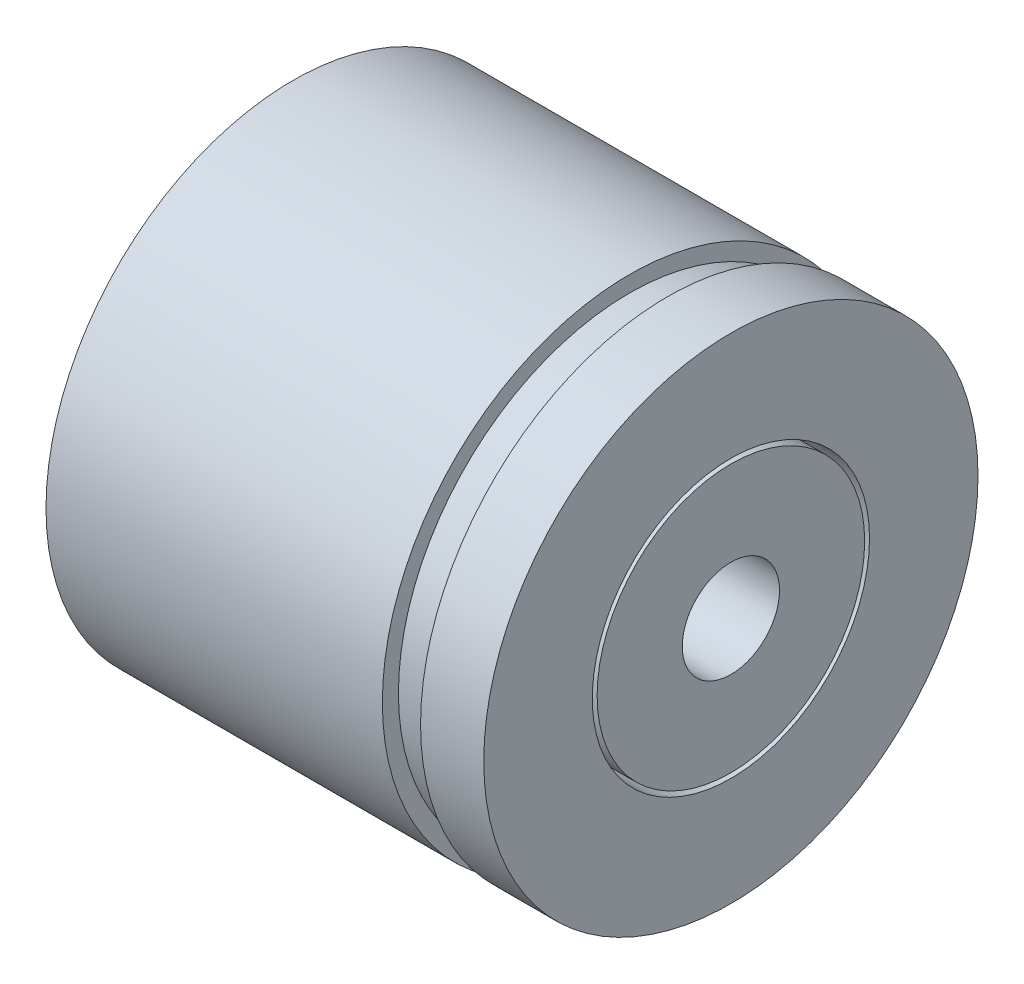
ISO-10303-21;
HEADER;
FILE_DESCRIPTION(('STEP AP214'),'2;1');
FILE_NAME('part.step','',(''),(''),'','','');
FILE_SCHEMA(('AUTOMOTIVE_DESIGN { 1 0 10303 214 1 1 1 1 }'));
ENDSEC;
DATA;
#1=APPLICATION_CONTEXT('core data for automotive mechanical design processes');
#2=APPLICATION_PROTOCOL_DEFINITION('international standard','automotive_design',2000,#1);
#3=PRODUCT_CONTEXT('',#1,'mechanical');
#4=PRODUCT('Part','Part','',(#3));
#5=PRODUCT_RELATED_PRODUCT_CATEGORY('part','',(#4));
#6=PRODUCT_DEFINITION_FORMATION('','',#4);
#7=PRODUCT_DEFINITION_CONTEXT('part definition',#1,'design');
#8=PRODUCT_DEFINITION('design','',#6,#7);
#9=PRODUCT_DEFINITION_SHAPE('','',#8);
#10=(LENGTH_UNIT() NAMED_UNIT(*) SI_UNIT(.MILLI.,.METRE.));
#11=(NAMED_UNIT(*) PLANE_ANGLE_UNIT() SI_UNIT($,.RADIAN.));
#12=(NAMED_UNIT(*) SI_UNIT($,.STERADIAN.) SOLID_ANGLE_UNIT());
#13=UNCERTAINTY_MEASURE_WITH_UNIT(LENGTH_MEASURE(1.E-05),#10,'distance_accuracy_value','');
#14=(GEOMETRIC_REPRESENTATION_CONTEXT(3) GLOBAL_UNCERTAINTY_ASSIGNED_CONTEXT((#13)) GLOBAL_UNIT_ASSIGNED_CONTEXT((#10,
#11,#12)) REPRESENTATION_CONTEXT('',''));
#15=CARTESIAN_POINT('',(0.,0.,0.));
#16=DIRECTION('',(0.,0.,1.));
#17=DIRECTION('',(1.,0.,0.));
#18=AXIS2_PLACEMENT_3D('',#15,#16,#17);
#19=CARTESIAN_POINT('',(0.,0.,0.));
#20=DIRECTION('',(1.,0.,0.));
#21=DIRECTION('',(0.,0.,-1.));
#22=AXIS2_PLACEMENT_3D('',#19,#20,#21);
#23=CYLINDRICAL_SURFACE('',#22,2.);
#24=CARTESIAN_POINT('',(0.,0.,0.));
#25=DIRECTION('',(1.,0.,0.));
#26=DIRECTION('',(0.,0.,-1.));
#27=AXIS2_PLACEMENT_3D('',#24,#25,#26);
#28=CIRCLE('',#27,2.);
#29=CARTESIAN_POINT('',(0.,0.,-2.));
#30=VERTEX_POINT('',#29);
#31=EDGE_CURVE('P0_E27',#30,#30,#28,.T.);
#32=ORIENTED_EDGE('',*,*,#31,.F.);
#33=EDGE_LOOP('',(#32));
#34=FACE_BOUND('',#33,.T.);
#35=CARTESIAN_POINT('',(18.,0.,0.));
#36=DIRECTION('',(1.,0.,0.));
#37=DIRECTION('',(0.,0.,-1.));
#38=AXIS2_PLACEMENT_3D('',#35,#36,#37);
#39=CIRCLE('',#38,2.);
#40=CARTESIAN_POINT('',(18.,0.,-2.));
#41=VERTEX_POINT('',#40);
#42=EDGE_CURVE('P0_E18',#41,#41,#39,.F.);
#43=ORIENTED_EDGE('',*,*,#42,.F.);
#44=EDGE_LOOP('',(#43));
#45=FACE_BOUND('',#44,.T.);
#46=ADVANCED_FACE('P0_F15',(#34,#45),#23,.F.);
#47=CARTESIAN_POINT('',(18.,0.,0.));
#48=DIRECTION('',(1.,0.,0.));
#49=DIRECTION('',(0.,0.,-1.));
#50=AXIS2_PLACEMENT_3D('',#47,#48,#49);
#51=PLANE('',#50);
#52=CARTESIAN_POINT('',(18.,0.,0.));
#53=DIRECTION('',(1.,0.,0.));
#54=DIRECTION('',(0.,0.,-1.));
#55=AXIS2_PLACEMENT_3D('',#52,#53,#54);
#56=CIRCLE('',#55,5.5);
#57=CARTESIAN_POINT('',(18.,0.,-5.5));
#58=VERTEX_POINT('',#57);
#59=EDGE_CURVE('P0_E22',#58,#58,#56,.F.);
#60=ORIENTED_EDGE('',*,*,#59,.F.);
#61=EDGE_LOOP('',(#60));
#62=FACE_BOUND('',#61,.T.);
#63=ORIENTED_EDGE('',*,*,#42,.T.);
#64=EDGE_LOOP('',(#63));
#65=FACE_BOUND('',#64,.T.);
#66=ADVANCED_FACE('P0_F35',(#62,#65),#51,.T.);
#67=CARTESIAN_POINT('',(0.,0.,0.));
#68=DIRECTION('',(-1.,0.,0.));
#69=DIRECTION('',(0.,0.,1.));
#70=AXIS2_PLACEMENT_3D('',#67,#68,#69);
#71=PLANE('',#70);
#72=CARTESIAN_POINT('',(0.,0.,0.));
#73=DIRECTION('',(1.,0.,0.));
#74=DIRECTION('',(0.,0.,-1.));
#75=AXIS2_PLACEMENT_3D('',#72,#73,#74);
#76=CIRCLE('',#75,5.5);
#77=CARTESIAN_POINT('',(0.,0.,-5.5));
#78=VERTEX_POINT('',#77);
#79=EDGE_CURVE('P0_E10',#78,#78,#76,.T.);
#80=ORIENTED_EDGE('',*,*,#79,.F.);
#81=EDGE_LOOP('',(#80));
#82=FACE_BOUND('',#81,.T.);
#83=ORIENTED_EDGE('',*,*,#31,.T.);
#84=EDGE_LOOP('',(#83));
#85=FACE_BOUND('',#84,.T.);
#86=ADVANCED_FACE('P0_F43',(#82,#85),#71,.T.);
#87=CARTESIAN_POINT('',(0.,0.,0.));
#88=DIRECTION('',(1.,0.,0.));
#89=DIRECTION('',(0.,0.,-1.));
#90=AXIS2_PLACEMENT_3D('',#87,#88,#89);
#91=CYLINDRICAL_SURFACE('',#90,5.5);
#92=ORIENTED_EDGE('',*,*,#79,.T.);
#93=EDGE_LOOP('',(#92));
#94=FACE_BOUND('',#93,.T.);
#95=ORIENTED_EDGE('',*,*,#59,.T.);
#96=EDGE_LOOP('',(#95));
#97=FACE_BOUND('',#96,.T.);
#98=ADVANCED_FACE('P0_F45',(#94,#97),#91,.T.);
#99=CLOSED_SHELL('',(#46,#66,#86,#98));
#100=MANIFOLD_SOLID_BREP('P0_B1',#99);
#101=CARTESIAN_POINT('',(0.,0.,0.));
#102=DIRECTION('',(1.,0.,0.));
#103=DIRECTION('',(0.,0.,-1.));
#104=AXIS2_PLACEMENT_3D('',#101,#102,#103);
#105=CYLINDRICAL_SURFACE('',#104,10.16);
#106=CARTESIAN_POINT('',(18.,0.,0.));
#107=DIRECTION('',(1.,0.,0.));
#108=DIRECTION('',(0.,0.,-1.));
#109=AXIS2_PLACEMENT_3D('',#106,#107,#108);
#110=CIRCLE('',#109,10.16);
#111=CARTESIAN_POINT('',(18.,0.,-10.16));
#112=VERTEX_POINT('',#111);
#113=EDGE_CURVE('P1_E18',#112,#112,#110,.T.);
#114=ORIENTED_EDGE('',*,*,#113,.F.);
#115=EDGE_LOOP('',(#114));
#116=FACE_BOUND('',#115,.T.);
#117=CARTESIAN_POINT('',(15.4,0.,0.));
#118=DIRECTION('',(1.,0.,0.));
#119=DIRECTION('',(0.,0.,-1.));
#120=AXIS2_PLACEMENT_3D('',#117,#118,#119);
#121=CIRCLE('',#120,10.16);
#122=CARTESIAN_POINT('',(15.4,0.,-10.16));
#123=VERTEX_POINT('',#122);
#124=EDGE_CURVE('P1_E40',#123,#123,#121,.T.);
#125=ORIENTED_EDGE('',*,*,#124,.T.);
#126=EDGE_LOOP('',(#125));
#127=FACE_BOUND('',#126,.T.);
#128=ADVANCED_FACE('P1_F15',(#116,#127),#105,.T.);
#129=CARTESIAN_POINT('',(18.,0.,0.));
#130=DIRECTION('',(1.,0.,0.));
#131=DIRECTION('',(0.,0.,-1.));
#132=AXIS2_PLACEMENT_3D('',#129,#130,#131);
#133=PLANE('',#132);
#134=ORIENTED_EDGE('',*,*,#113,.T.);
#135=EDGE_LOOP('',(#134));
#136=FACE_BOUND('',#135,.T.);
#137=CARTESIAN_POINT('',(18.,0.,0.));
#138=DIRECTION('',(1.,0.,0.));
#139=DIRECTION('',(0.,0.,-1.));
#140=AXIS2_PLACEMENT_3D('',#137,#138,#139);
#141=CIRCLE('',#140,5.7);
#142=CARTESIAN_POINT('',(18.,0.,-5.7));
#143=VERTEX_POINT('',#142);
#144=EDGE_CURVE('P1_E38',#143,#143,#141,.F.);
#145=ORIENTED_EDGE('',*,*,#144,.T.);
#146=EDGE_LOOP('',(#145));
#147=FACE_BOUND('',#146,.T.);
#148=ADVANCED_FACE('P1_F47',(#136,#147),#133,.T.);
#149=CARTESIAN_POINT('',(15.4,0.,0.));
#150=DIRECTION('',(1.,0.,0.));
#151=DIRECTION('',(0.,0.,-1.));
#152=AXIS2_PLACEMENT_3D('',#149,#150,#151);
#153=PLANE('',#152);
#154=CARTESIAN_POINT('',(15.4,0.,0.));
#155=DIRECTION('',(1.,0.,0.));
#156=DIRECTION('',(0.,0.,-1.));
#157=AXIS2_PLACEMENT_3D('',#154,#155,#156);
#158=CIRCLE('',#157,9.5);
#159=CARTESIAN_POINT('',(15.4,0.,-9.5));
#160=VERTEX_POINT('',#159);
#161=EDGE_CURVE('P1_E35',#160,#160,#158,.F.);
#162=ORIENTED_EDGE('',*,*,#161,.F.);
#163=EDGE_LOOP('',(#162));
#164=FACE_BOUND('',#163,.T.);
#165=ORIENTED_EDGE('',*,*,#124,.F.);
#166=EDGE_LOOP('',(#165));
#167=FACE_BOUND('',#166,.T.);
#168=ADVANCED_FACE('P1_F55',(#164,#167),#153,.F.);
#169=CARTESIAN_POINT('',(0.,0.,0.));
#170=DIRECTION('',(1.,0.,0.));
#171=DIRECTION('',(0.,0.,-1.));
#172=AXIS2_PLACEMENT_3D('',#169,#170,#171);
#173=CYLINDRICAL_SURFACE('',#172,5.7);
#174=CARTESIAN_POINT('',(0.,0.,0.));
#175=DIRECTION('',(1.,0.,0.));
#176=DIRECTION('',(0.,0.,-1.));
#177=AXIS2_PLACEMENT_3D('',#174,#175,#176);
#178=CIRCLE('',#177,5.7);
#179=CARTESIAN_POINT('',(0.,0.,-5.7));
#180=VERTEX_POINT('',#179);
#181=EDGE_CURVE('P1_E32',#180,#180,#178,.T.);
#182=ORIENTED_EDGE('',*,*,#181,.F.);
#183=EDGE_LOOP('',(#182));
#184=FACE_BOUND('',#183,.T.);
#185=ORIENTED_EDGE('',*,*,#144,.F.);
#186=EDGE_LOOP('',(#185));
#187=FACE_BOUND('',#186,.T.);
#188=ADVANCED_FACE('P1_F74',(#184,#187),#173,.F.);
#189=CARTESIAN_POINT('',(14.615,0.,0.));
#190=DIRECTION('',(1.,0.,0.));
#191=DIRECTION('',(0.,0.,-1.));
#192=AXIS2_PLACEMENT_3D('',#189,#190,#191);
#193=CYLINDRICAL_SURFACE('',#192,9.5);
#194=CARTESIAN_POINT('',(13.83,0.,0.));
#195=DIRECTION('',(1.,0.,0.));
#196=DIRECTION('',(0.,0.,-1.));
#197=AXIS2_PLACEMENT_3D('',#194,#195,#196);
#198=CIRCLE('',#197,9.5);
#199=CARTESIAN_POINT('',(13.83,0.,-9.5));
#200=VERTEX_POINT('',#199);
#201=EDGE_CURVE('P1_E27',#200,#200,#198,.F.);
#202=ORIENTED_EDGE('',*,*,#201,.F.);
#203=EDGE_LOOP('',(#202));
#204=FACE_BOUND('',#203,.T.);
#205=ORIENTED_EDGE('',*,*,#161,.T.);
#206=EDGE_LOOP('',(#205));
#207=FACE_BOUND('',#206,.T.);
#208=ADVANCED_FACE('P1_F70',(#204,#207),#193,.T.);
#209=CARTESIAN_POINT('',(0.,0.,0.));
#210=DIRECTION('',(-1.,0.,0.));
#211=DIRECTION('',(0.,0.,1.));
#212=AXIS2_PLACEMENT_3D('',#209,#210,#211);
#213=PLANE('',#212);
#214=CARTESIAN_POINT('',(0.,0.,0.));
#215=DIRECTION('',(1.,0.,0.));
#216=DIRECTION('',(0.,0.,-1.));
#217=AXIS2_PLACEMENT_3D('',#214,#215,#216);
#218=CIRCLE('',#217,10.16);
#219=CARTESIAN_POINT('',(0.,0.,-10.16));
#220=VERTEX_POINT('',#219);
#221=EDGE_CURVE('P1_E22',#220,#220,#218,.T.);
#222=ORIENTED_EDGE('',*,*,#221,.F.);
#223=EDGE_LOOP('',(#222));
#224=FACE_BOUND('',#223,.T.);
#225=ORIENTED_EDGE('',*,*,#181,.T.);
#226=EDGE_LOOP('',(#225));
#227=FACE_BOUND('',#226,.T.);
#228=ADVANCED_FACE('P1_F63',(#224,#227),#213,.T.);
#229=CARTESIAN_POINT('',(13.83,0.,0.));
#230=DIRECTION('',(1.,0.,0.));
#231=DIRECTION('',(0.,0.,-1.));
#232=AXIS2_PLACEMENT_3D('',#229,#230,#231);
#233=PLANE('',#232);
#234=ORIENTED_EDGE('',*,*,#201,.T.);
#235=EDGE_LOOP('',(#234));
#236=FACE_BOUND('',#235,.T.);
#237=CARTESIAN_POINT('',(13.83,0.,0.));
#238=DIRECTION('',(1.,0.,0.));
#239=DIRECTION('',(0.,0.,-1.));
#240=AXIS2_PLACEMENT_3D('',#237,#238,#239);
#241=CIRCLE('',#240,10.16);
#242=CARTESIAN_POINT('',(13.83,0.,-10.16));
#243=VERTEX_POINT('',#242);
#244=EDGE_CURVE('P1_E10',#243,#243,#241,.F.);
#245=ORIENTED_EDGE('',*,*,#244,.F.);
#246=EDGE_LOOP('',(#245));
#247=FACE_BOUND('',#246,.T.);
#248=ADVANCED_FACE('P1_F58',(#236,#247),#233,.T.);
#249=CARTESIAN_POINT('',(0.,0.,0.));
#250=DIRECTION('',(1.,0.,0.));
#251=DIRECTION('',(0.,0.,-1.));
#252=AXIS2_PLACEMENT_3D('',#249,#250,#251);
#253=CYLINDRICAL_SURFACE('',#252,10.16);
#254=ORIENTED_EDGE('',*,*,#244,.T.);
#255=EDGE_LOOP('',(#254));
#256=FACE_BOUND('',#255,.T.);
#257=ORIENTED_EDGE('',*,*,#221,.T.);
#258=EDGE_LOOP('',(#257));
#259=FACE_BOUND('',#258,.T.);
#260=ADVANCED_FACE('P1_F56',(#256,#259),#253,.T.);
#261=CLOSED_SHELL('',(#128,#148,#168,#188,#208,#228,#248,#260));
#262=MANIFOLD_SOLID_BREP('P1_B1',#261);
#263=ADVANCED_BREP_SHAPE_REPRESENTATION('',(#18,#100,#262),#14);
#264=SHAPE_DEFINITION_REPRESENTATION(#9,#263);
ENDSEC;
END-ISO-10303-21;
